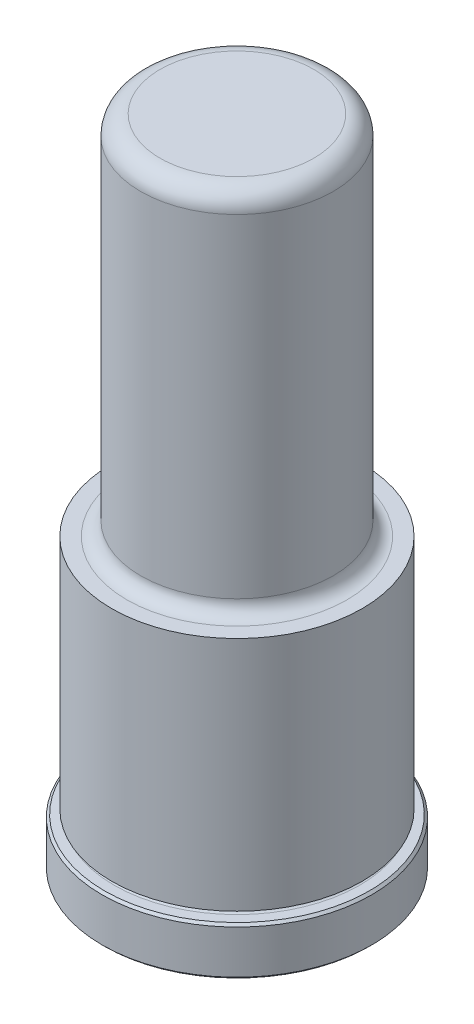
ISO-10303-21;
HEADER;
FILE_DESCRIPTION(('STEP AP214'),'2;1');
FILE_NAME('part.step','',(''),(''),'','','');
FILE_SCHEMA(('AUTOMOTIVE_DESIGN { 1 0 10303 214 1 1 1 1 }'));
ENDSEC;
DATA;
#1=APPLICATION_CONTEXT('core data for automotive mechanical design processes');
#2=APPLICATION_PROTOCOL_DEFINITION('international standard','automotive_design',2000,#1);
#3=PRODUCT_CONTEXT('',#1,'mechanical');
#4=PRODUCT('Part','Part','',(#3));
#5=PRODUCT_RELATED_PRODUCT_CATEGORY('part','',(#4));
#6=PRODUCT_DEFINITION_FORMATION('','',#4);
#7=PRODUCT_DEFINITION_CONTEXT('part definition',#1,'design');
#8=PRODUCT_DEFINITION('design','',#6,#7);
#9=PRODUCT_DEFINITION_SHAPE('','',#8);
#10=(LENGTH_UNIT() NAMED_UNIT(*) SI_UNIT(.MILLI.,.METRE.));
#11=(NAMED_UNIT(*) PLANE_ANGLE_UNIT() SI_UNIT($,.RADIAN.));
#12=(NAMED_UNIT(*) SI_UNIT($,.STERADIAN.) SOLID_ANGLE_UNIT());
#13=UNCERTAINTY_MEASURE_WITH_UNIT(LENGTH_MEASURE(1.E-05),#10,'distance_accuracy_value','');
#14=(GEOMETRIC_REPRESENTATION_CONTEXT(3) GLOBAL_UNCERTAINTY_ASSIGNED_CONTEXT((#13)) GLOBAL_UNIT_ASSIGNED_CONTEXT((#10,
#11,#12)) REPRESENTATION_CONTEXT('',''));
#15=CARTESIAN_POINT('',(0.,0.,0.));
#16=DIRECTION('',(0.,0.,1.));
#17=DIRECTION('',(1.,0.,0.));
#18=AXIS2_PLACEMENT_3D('',#15,#16,#17);
#19=CARTESIAN_POINT('',(0.,0.,0.));
#20=DIRECTION('',(0.,1.,0.));
#21=DIRECTION('',(0.,0.,1.));
#22=AXIS2_PLACEMENT_3D('',#19,#20,#21);
#23=PLANE('',#22);
#24=CARTESIAN_POINT('',(0.,0.,0.));
#25=DIRECTION('',(0.,1.,0.));
#26=DIRECTION('',(0.,0.,1.));
#27=AXIS2_PLACEMENT_3D('',#24,#25,#26);
#28=CIRCLE('',#27,21.844);
#29=CARTESIAN_POINT('',(0.,0.,21.844));
#30=VERTEX_POINT('',#29);
#31=EDGE_CURVE('E46',#30,#30,#28,.F.);
#32=ORIENTED_EDGE('',*,*,#31,.T.);
#33=EDGE_LOOP('',(#32));
#34=FACE_BOUND('',#33,.T.);
#35=ADVANCED_FACE('F31',(#34),#23,.F.);
#36=CARTESIAN_POINT('',(0.,0.,0.));
#37=DIRECTION('',(0.,1.,0.));
#38=DIRECTION('',(0.,0.,1.));
#39=AXIS2_PLACEMENT_3D('',#36,#37,#38);
#40=CYLINDRICAL_SURFACE('',#39,22.225);
#41=CARTESIAN_POINT('',(0.,0.380999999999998,0.));
#42=DIRECTION('',(0.,1.,0.));
#43=DIRECTION('',(0.,0.,1.));
#44=AXIS2_PLACEMENT_3D('',#41,#42,#43);
#45=CIRCLE('',#44,22.225);
#46=CARTESIAN_POINT('',(0.,0.380999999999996,22.225));
#47=VERTEX_POINT('',#46);
#48=EDGE_CURVE('E51',#47,#47,#45,.T.);
#49=ORIENTED_EDGE('',*,*,#48,.T.);
#50=EDGE_LOOP('',(#49));
#51=FACE_BOUND('',#50,.T.);
#52=CARTESIAN_POINT('',(0.,7.54380000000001,0.));
#53=DIRECTION('',(0.,-1.,0.));
#54=DIRECTION('',(0.,0.,-1.));
#55=AXIS2_PLACEMENT_3D('',#52,#53,#54);
#56=CIRCLE('',#55,22.225);
#57=CARTESIAN_POINT('',(0.,7.54380000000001,-22.225));
#58=VERTEX_POINT('',#57);
#59=EDGE_CURVE('E54',#58,#58,#56,.T.);
#60=ORIENTED_EDGE('',*,*,#59,.T.);
#61=EDGE_LOOP('',(#60));
#62=FACE_BOUND('',#61,.T.);
#63=ADVANCED_FACE('F110',(#51,#62),#40,.T.);
#64=CARTESIAN_POINT('',(0.,7.9248,-22.225));
#65=DIRECTION('',(0.,-1.,0.));
#66=DIRECTION('',(0.,0.,-1.));
#67=AXIS2_PLACEMENT_3D('',#64,#65,#66);
#68=PLANE('',#67);
#69=CARTESIAN_POINT('',(0.,7.9248,0.));
#70=DIRECTION('',(0.,-1.,0.));
#71=DIRECTION('',(0.,0.,-1.));
#72=AXIS2_PLACEMENT_3D('',#69,#70,#71);
#73=CIRCLE('',#72,21.844);
#74=CARTESIAN_POINT('',(0.,7.9248,-21.844));
#75=VERTEX_POINT('',#74);
#76=EDGE_CURVE('E42',#75,#75,#73,.F.);
#77=ORIENTED_EDGE('',*,*,#76,.T.);
#78=EDGE_LOOP('',(#77));
#79=FACE_BOUND('',#78,.T.);
#80=CARTESIAN_POINT('',(0.,7.9248,0.));
#81=DIRECTION('',(0.,1.,0.));
#82=DIRECTION('',(0.,0.,1.));
#83=AXIS2_PLACEMENT_3D('',#80,#81,#82);
#84=CIRCLE('',#83,20.2438);
#85=CARTESIAN_POINT('',(0.,7.92479999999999,20.2438));
#86=VERTEX_POINT('',#85);
#87=EDGE_CURVE('E57',#86,#86,#84,.T.);
#88=ORIENTED_EDGE('',*,*,#87,.F.);
#89=EDGE_LOOP('',(#88));
#90=FACE_BOUND('',#89,.T.);
#91=ADVANCED_FACE('F105',(#79,#90),#68,.F.);
#92=CARTESIAN_POINT('',(0.,8.3058,0.));
#93=DIRECTION('',(0.,1.,0.));
#94=DIRECTION('',(0.,0.,1.));
#95=AXIS2_PLACEMENT_3D('',#92,#93,#94);
#96=TOROIDAL_SURFACE('',#95,20.2438,0.380999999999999);
#97=CARTESIAN_POINT('',(0.,8.6868,0.));
#98=DIRECTION('',(0.,1.,0.));
#99=DIRECTION('',(0.,0.,1.));
#100=AXIS2_PLACEMENT_3D('',#97,#98,#99);
#101=CIRCLE('',#100,20.2438);
#102=CARTESIAN_POINT('',(0.,8.68679999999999,20.2438));
#103=VERTEX_POINT('',#102);
#104=EDGE_CURVE('E60',#103,#103,#101,.T.);
#105=ORIENTED_EDGE('',*,*,#104,.F.);
#106=EDGE_LOOP('',(#105));
#107=FACE_BOUND('',#106,.T.);
#108=ORIENTED_EDGE('',*,*,#87,.T.);
#109=EDGE_LOOP('',(#108));
#110=FACE_BOUND('',#109,.T.);
#111=ADVANCED_FACE('F99',(#107,#110),#96,.F.);
#112=CARTESIAN_POINT('',(0.,8.6868,-20.2438));
#113=DIRECTION('',(0.,1.,0.));
#114=DIRECTION('',(0.,0.,1.));
#115=AXIS2_PLACEMENT_3D('',#112,#113,#114);
#116=PLANE('',#115);
#117=CARTESIAN_POINT('',(0.,8.6868,0.));
#118=DIRECTION('',(0.,1.,0.));
#119=DIRECTION('',(0.,0.,1.));
#120=AXIS2_PLACEMENT_3D('',#117,#118,#119);
#121=CIRCLE('',#120,20.6502);
#122=CARTESIAN_POINT('',(0.,8.6868,20.6502));
#123=VERTEX_POINT('',#122);
#124=EDGE_CURVE('E63',#123,#123,#121,.T.);
#125=ORIENTED_EDGE('',*,*,#124,.F.);
#126=EDGE_LOOP('',(#125));
#127=FACE_BOUND('',#126,.T.);
#128=ORIENTED_EDGE('',*,*,#104,.T.);
#129=EDGE_LOOP('',(#128));
#130=FACE_BOUND('',#129,.T.);
#131=ADVANCED_FACE('F93',(#127,#130),#116,.F.);
#132=CARTESIAN_POINT('',(0.,0.,0.));
#133=DIRECTION('',(0.,1.,0.));
#134=DIRECTION('',(0.,0.,1.));
#135=AXIS2_PLACEMENT_3D('',#132,#133,#134);
#136=CYLINDRICAL_SURFACE('',#135,20.6502);
#137=CARTESIAN_POINT('',(0.,47.625,0.));
#138=DIRECTION('',(0.,1.,0.));
#139=DIRECTION('',(0.,0.,1.));
#140=AXIS2_PLACEMENT_3D('',#137,#138,#139);
#141=CIRCLE('',#140,20.6502);
#142=CARTESIAN_POINT('',(0.,47.625,20.6502));
#143=VERTEX_POINT('',#142);
#144=EDGE_CURVE('E66',#143,#143,#141,.T.);
#145=ORIENTED_EDGE('',*,*,#144,.F.);
#146=EDGE_LOOP('',(#145));
#147=FACE_BOUND('',#146,.T.);
#148=ORIENTED_EDGE('',*,*,#124,.T.);
#149=EDGE_LOOP('',(#148));
#150=FACE_BOUND('',#149,.T.);
#151=ADVANCED_FACE('F87',(#147,#150),#136,.T.);
#152=CARTESIAN_POINT('',(0.,47.625,-20.6502));
#153=DIRECTION('',(0.,-1.,0.));
#154=DIRECTION('',(0.,0.,-1.));
#155=AXIS2_PLACEMENT_3D('',#152,#153,#154);
#156=PLANE('',#155);
#157=CARTESIAN_POINT('',(0.,47.625,0.));
#158=DIRECTION('',(0.,1.,0.));
#159=DIRECTION('',(0.,0.,1.));
#160=AXIS2_PLACEMENT_3D('',#157,#158,#159);
#161=CIRCLE('',#160,18.1483);
#162=CARTESIAN_POINT('',(0.,47.625,18.1483));
#163=VERTEX_POINT('',#162);
#164=EDGE_CURVE('E69',#163,#163,#161,.T.);
#165=ORIENTED_EDGE('',*,*,#164,.F.);
#166=EDGE_LOOP('',(#165));
#167=FACE_BOUND('',#166,.T.);
#168=ORIENTED_EDGE('',*,*,#144,.T.);
#169=EDGE_LOOP('',(#168));
#170=FACE_BOUND('',#169,.T.);
#171=ADVANCED_FACE('F81',(#167,#170),#156,.F.);
#172=CARTESIAN_POINT('',(0.,49.911,0.));
#173=DIRECTION('',(0.,1.,0.));
#174=DIRECTION('',(0.,0.,1.));
#175=AXIS2_PLACEMENT_3D('',#172,#173,#174);
#176=TOROIDAL_SURFACE('',#175,18.1483,2.286);
#177=CARTESIAN_POINT('',(0.,49.911,0.));
#178=DIRECTION('',(0.,1.,0.));
#179=DIRECTION('',(0.,0.,1.));
#180=AXIS2_PLACEMENT_3D('',#177,#178,#179);
#181=CIRCLE('',#180,15.8623);
#182=CARTESIAN_POINT('',(0.,49.911,15.8623));
#183=VERTEX_POINT('',#182);
#184=EDGE_CURVE('E72',#183,#183,#181,.T.);
#185=ORIENTED_EDGE('',*,*,#184,.F.);
#186=EDGE_LOOP('',(#185));
#187=FACE_BOUND('',#186,.T.);
#188=ORIENTED_EDGE('',*,*,#164,.T.);
#189=EDGE_LOOP('',(#188));
#190=FACE_BOUND('',#189,.T.);
#191=ADVANCED_FACE('F78',(#187,#190),#176,.F.);
#192=CARTESIAN_POINT('',(0.,0.,0.));
#193=DIRECTION('',(0.,1.,0.));
#194=DIRECTION('',(0.,0.,1.));
#195=AXIS2_PLACEMENT_3D('',#192,#193,#194);
#196=CYLINDRICAL_SURFACE('',#195,15.8623);
#197=CARTESIAN_POINT('',(0.,104.775,0.));
#198=DIRECTION('',(0.,-1.,0.));
#199=DIRECTION('',(0.,0.,-1.));
#200=AXIS2_PLACEMENT_3D('',#197,#198,#199);
#201=CIRCLE('',#200,15.8623);
#202=CARTESIAN_POINT('',(0.,104.775,-15.8623));
#203=VERTEX_POINT('',#202);
#204=EDGE_CURVE('E10',#203,#203,#201,.T.);
#205=ORIENTED_EDGE('',*,*,#204,.T.);
#206=EDGE_LOOP('',(#205));
#207=FACE_BOUND('',#206,.T.);
#208=ORIENTED_EDGE('',*,*,#184,.T.);
#209=EDGE_LOOP('',(#208));
#210=FACE_BOUND('',#209,.T.);
#211=ADVANCED_FACE('F76',(#207,#210),#196,.T.);
#212=CARTESIAN_POINT('',(0.,107.95,-15.8623));
#213=DIRECTION('',(0.,-1.,0.));
#214=DIRECTION('',(0.,0.,-1.));
#215=AXIS2_PLACEMENT_3D('',#212,#213,#214);
#216=PLANE('',#215);
#217=CARTESIAN_POINT('',(0.,107.95,0.));
#218=DIRECTION('',(0.,-1.,0.));
#219=DIRECTION('',(0.,0.,-1.));
#220=AXIS2_PLACEMENT_3D('',#217,#218,#219);
#221=CIRCLE('',#220,12.6873);
#222=CARTESIAN_POINT('',(0.,107.95,-12.6873));
#223=VERTEX_POINT('',#222);
#224=EDGE_CURVE('E38',#223,#223,#221,.F.);
#225=ORIENTED_EDGE('',*,*,#224,.T.);
#226=EDGE_LOOP('',(#225));
#227=FACE_BOUND('',#226,.T.);
#228=ADVANCED_FACE('F127',(#227),#216,.F.);
#229=CARTESIAN_POINT('',(0.,0.380999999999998,0.));
#230=DIRECTION('',(0.,1.,0.));
#231=DIRECTION('',(0.,0.,1.));
#232=AXIS2_PLACEMENT_3D('',#229,#230,#231);
#233=CONICAL_SURFACE('',#232,22.225,0.785398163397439);
#234=CARTESIAN_POINT('',(0.,0.,21.844));
#235=CARTESIAN_POINT('',(0.,0.00396874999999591,21.84796875));
#236=CARTESIAN_POINT('',(0.,0.0079374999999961,21.8519375));
#237=CARTESIAN_POINT('',(0.,0.0158749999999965,21.859875));
#238=CARTESIAN_POINT('',(0.,0.0198437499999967,21.86384375));
#239=CARTESIAN_POINT('',(0.,0.0277812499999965,21.87178125));
#240=CARTESIAN_POINT('',(0.,0.031749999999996,21.87575));
#241=CARTESIAN_POINT('',(0.,0.0396874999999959,21.8836875));
#242=CARTESIAN_POINT('',(0.,0.0436562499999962,21.88765625));
#243=CARTESIAN_POINT('',(0.,0.0515937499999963,21.89559375));
#244=CARTESIAN_POINT('',(0.,0.0555624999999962,21.8995625));
#245=CARTESIAN_POINT('',(0.,0.0634999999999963,21.9075));
#246=CARTESIAN_POINT('',(0.,0.0674687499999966,21.91146875));
#247=CARTESIAN_POINT('',(0.,0.0754062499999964,21.91940625));
#248=CARTESIAN_POINT('',(0.,0.079374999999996,21.923375));
#249=CARTESIAN_POINT('',(0.,0.0873124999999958,21.9313125));
#250=CARTESIAN_POINT('',(0.,0.0912812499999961,21.93528125));
#251=CARTESIAN_POINT('',(0.,0.0992187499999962,21.94321875));
#252=CARTESIAN_POINT('',(0.,0.103187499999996,21.9471875));
#253=CARTESIAN_POINT('',(0.,0.111124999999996,21.955125));
#254=CARTESIAN_POINT('',(0.,0.115093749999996,21.95909375));
#255=CARTESIAN_POINT('',(0.,0.123031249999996,21.96703125));
#256=CARTESIAN_POINT('',(0.,0.126999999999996,21.971));
#257=CARTESIAN_POINT('',(0.,0.134937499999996,21.9789375));
#258=CARTESIAN_POINT('',(0.,0.138906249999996,21.98290625));
#259=CARTESIAN_POINT('',(0.,0.146843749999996,21.99084375));
#260=CARTESIAN_POINT('',(0.,0.150812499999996,21.9948125));
#261=CARTESIAN_POINT('',(0.,0.158749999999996,22.00275));
#262=CARTESIAN_POINT('',(0.,0.162718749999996,22.00671875));
#263=CARTESIAN_POINT('',(0.,0.170656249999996,22.01465625));
#264=CARTESIAN_POINT('',(0.,0.174624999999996,22.018625));
#265=CARTESIAN_POINT('',(0.,0.182562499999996,22.0265625));
#266=CARTESIAN_POINT('',(0.,0.186531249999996,22.03053125));
#267=CARTESIAN_POINT('',(0.,0.194468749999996,22.03846875));
#268=CARTESIAN_POINT('',(0.,0.198437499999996,22.0424375));
#269=CARTESIAN_POINT('',(0.,0.206374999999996,22.050375));
#270=CARTESIAN_POINT('',(0.,0.210343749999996,22.05434375));
#271=CARTESIAN_POINT('',(0.,0.218281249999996,22.06228125));
#272=CARTESIAN_POINT('',(0.,0.222249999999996,22.06625));
#273=CARTESIAN_POINT('',(0.,0.230187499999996,22.0741875));
#274=CARTESIAN_POINT('',(0.,0.234156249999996,22.07815625));
#275=CARTESIAN_POINT('',(0.,0.242093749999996,22.08609375));
#276=CARTESIAN_POINT('',(0.,0.246062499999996,22.0900625));
#277=CARTESIAN_POINT('',(0.,0.253999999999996,22.098));
#278=CARTESIAN_POINT('',(0.,0.257968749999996,22.10196875));
#279=CARTESIAN_POINT('',(0.,0.265906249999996,22.10990625));
#280=CARTESIAN_POINT('',(0.,0.269874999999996,22.113875));
#281=CARTESIAN_POINT('',(0.,0.277812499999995,22.1218125));
#282=CARTESIAN_POINT('',(0.,0.281781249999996,22.12578125));
#283=CARTESIAN_POINT('',(0.,0.289718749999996,22.13371875));
#284=CARTESIAN_POINT('',(0.,0.293687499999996,22.1376875));
#285=CARTESIAN_POINT('',(0.,0.301624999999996,22.145625));
#286=CARTESIAN_POINT('',(0.,0.305593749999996,22.14959375));
#287=CARTESIAN_POINT('',(0.,0.313531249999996,22.15753125));
#288=CARTESIAN_POINT('',(0.,0.317499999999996,22.1615));
#289=CARTESIAN_POINT('',(0.,0.325437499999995,22.1694375));
#290=CARTESIAN_POINT('',(0.,0.329406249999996,22.17340625));
#291=CARTESIAN_POINT('',(0.,0.337343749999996,22.18134375));
#292=CARTESIAN_POINT('',(0.,0.341312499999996,22.1853125));
#293=CARTESIAN_POINT('',(0.,0.349249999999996,22.19325));
#294=CARTESIAN_POINT('',(0.,0.353218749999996,22.19721875));
#295=CARTESIAN_POINT('',(0.,0.361156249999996,22.20515625));
#296=CARTESIAN_POINT('',(0.,0.365124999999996,22.209125));
#297=CARTESIAN_POINT('',(0.,0.373062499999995,22.2170625));
#298=CARTESIAN_POINT('',(0.,0.377031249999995,22.22103125));
#299=CARTESIAN_POINT('',(0.,0.380999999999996,22.225));
#300=B_SPLINE_CURVE_WITH_KNOTS('',3,(#234,#235,#236,#237,#238,#239,#240,#241,#242,#243,#244,
#245,#246,#247,#248,#249,#250,#251,#252,#253,#254,#255,#256,#257,#258,#259,#260,#261,#262,#263,
#264,#265,#266,#267,#268,#269,#270,#271,#272,#273,#274,#275,#276,#277,#278,#279,#280,#281,#282,
#283,#284,#285,#286,#287,#288,#289,#290,#291,#292,#293,#294,#295,#296,#297,#298,#299),
.UNSPECIFIED.,.F.,.F.,(4,2,2,2,2,2,2,2,2,2,2,2,2,2,2,2,2,2,2,2,2,2,2,2,2,2,2,2,2,2,2,2,4),(0.,
0.0168379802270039,0.0336759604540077,0.0505139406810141,0.0673519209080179,0.0841899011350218,
0.101027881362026,0.117865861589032,0.134703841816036,0.15154182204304,0.168379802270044,
0.18521778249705,0.202055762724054,0.218893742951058,0.235731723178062,0.252569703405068,
0.269407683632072,0.286245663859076,0.303083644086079,0.319921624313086,0.33675960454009,
0.353597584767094,0.370435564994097,0.387273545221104,0.404111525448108,0.420949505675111,
0.437787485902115,0.454625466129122,0.471463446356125,0.488301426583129,0.505139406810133,
0.521977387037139,0.538815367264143),.UNSPECIFIED.);
#301=EDGE_CURVE('BSEAM124',#30,#47,#300,.T.);
#302=ORIENTED_EDGE('',*,*,#31,.F.);
#303=ORIENTED_EDGE('',*,*,#48,.F.);
#304=ORIENTED_EDGE('',*,*,#301,.T.);
#305=ORIENTED_EDGE('',*,*,#301,.F.);
#306=EDGE_LOOP('',(#302,#304,#303,#305));
#307=FACE_BOUND('',#306,.T.);
#308=ADVANCED_FACE('F124',(#307),#233,.T.);
#309=CARTESIAN_POINT('',(0.,7.9248,0.));
#310=DIRECTION('',(0.,-1.,0.));
#311=DIRECTION('',(0.,0.,-1.));
#312=AXIS2_PLACEMENT_3D('',#309,#310,#311);
#313=CONICAL_SURFACE('',#312,21.844,0.785398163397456);
#314=ORIENTED_EDGE('',*,*,#59,.F.);
#315=EDGE_LOOP('',(#314));
#316=FACE_BOUND('',#315,.T.);
#317=ORIENTED_EDGE('',*,*,#76,.F.);
#318=EDGE_LOOP('',(#317));
#319=FACE_BOUND('',#318,.T.);
#320=ADVANCED_FACE('F126',(#316,#319),#313,.T.);
#321=CARTESIAN_POINT('',(0.,104.775,0.));
#322=DIRECTION('',(0.,-1.,0.));
#323=DIRECTION('',(0.,0.,-1.));
#324=AXIS2_PLACEMENT_3D('',#321,#322,#323);
#325=TOROIDAL_SURFACE('',#324,12.6873,3.175);
#326=ORIENTED_EDGE('',*,*,#204,.F.);
#327=EDGE_LOOP('',(#326));
#328=FACE_BOUND('',#327,.T.);
#329=ORIENTED_EDGE('',*,*,#224,.F.);
#330=EDGE_LOOP('',(#329));
#331=FACE_BOUND('',#330,.T.);
#332=ADVANCED_FACE('F33',(#328,#331),#325,.T.);
#333=CLOSED_SHELL('',(#35,#63,#91,#111,#131,#151,#171,#191,#211,#228,#308,#320,#332));
#334=MANIFOLD_SOLID_BREP('B2',#333);
#335=ADVANCED_BREP_SHAPE_REPRESENTATION('',(#18,#334),#14);
#336=SHAPE_DEFINITION_REPRESENTATION(#9,#335);
ENDSEC;
END-ISO-10303-21;
